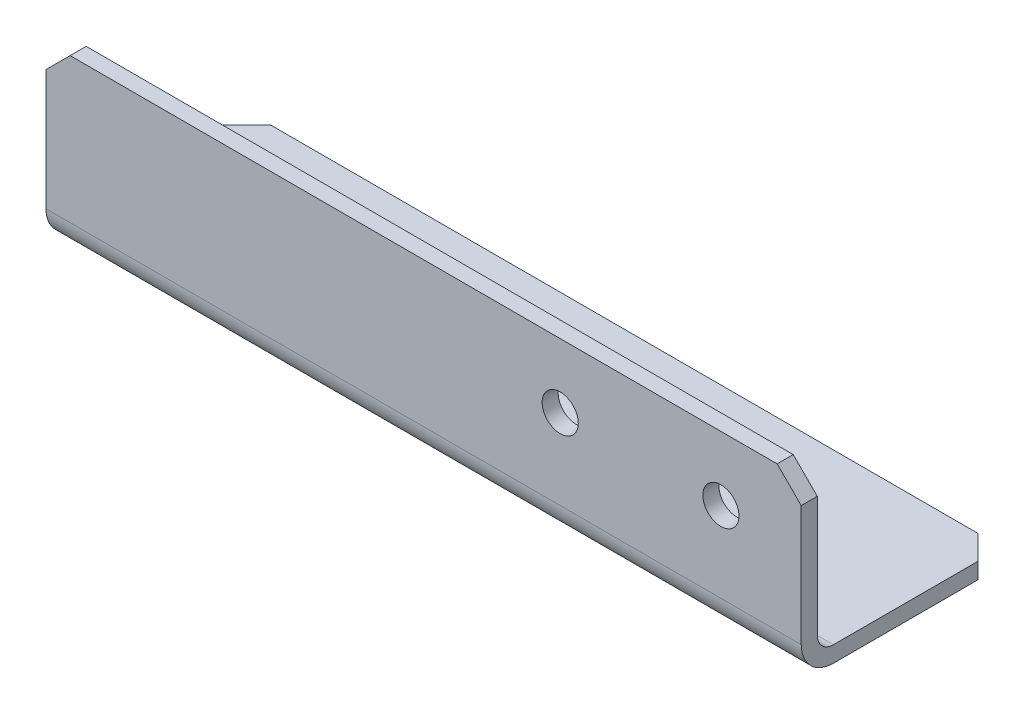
from build123d import *

# Parameters (mm, degrees)
EXTRUDE_1_DEPTH     = 94
SKETCH_2_R          = 2.25
CUT_EXTRUDE_1_DEPTH = 10
CHAMFER_1_SIZE      = 3


with BuildPart() as part:
    # Sketch 1 → Extrude 1 (new body)
    with BuildSketch(Plane(origin=(0, 0, 0), x_dir=(0, 0, -1), z_dir=(1, 0, 0))):
        with BuildLine():
            Line((4, 0), (25, 0))
            Line((25, 0), (25, 2))
            Line((25, 2), (4, 2))
            ThreePointArc((4, 2), (2.585786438, 2.585786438), (2, 4))
            Line((2, 4), (2, 22))
            Line((2, 22), (0, 22))
            Line((0, 22), (0, 4))
            ThreePointArc((0, 4), (1.171572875, 1.171572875), (4, 0))
        make_face()
    extrude(amount=EXTRUDE_1_DEPTH)

    # Sketch 2 → Cut-Extrude 1 (cut)
    with BuildSketch(Plane(origin=(0, 0, -2), x_dir=(-1, 0, 0), z_dir=(0, 0, -1))):
        with Locations(Location((-84, 14, 0), (0, 0, 90))):
            Circle(SKETCH_2_R)
        with Locations(Location((-64, 14, 0), (0, 0, 90))):
            Circle(SKETCH_2_R)
    extrude(amount=-CUT_EXTRUDE_1_DEPTH, mode=Mode.SUBTRACT)

    # Chamfer 1
    chamfer_1_edges = [part.edges().sort_by_distance(p)[0] for p in [
        (0, 1, -25),
        (94, 22, -1),
        (94, 1, -25),
        (0, 22, -1),
    ]]
    chamfer(chamfer_1_edges, length=CHAMFER_1_SIZE)


solid = part.part
